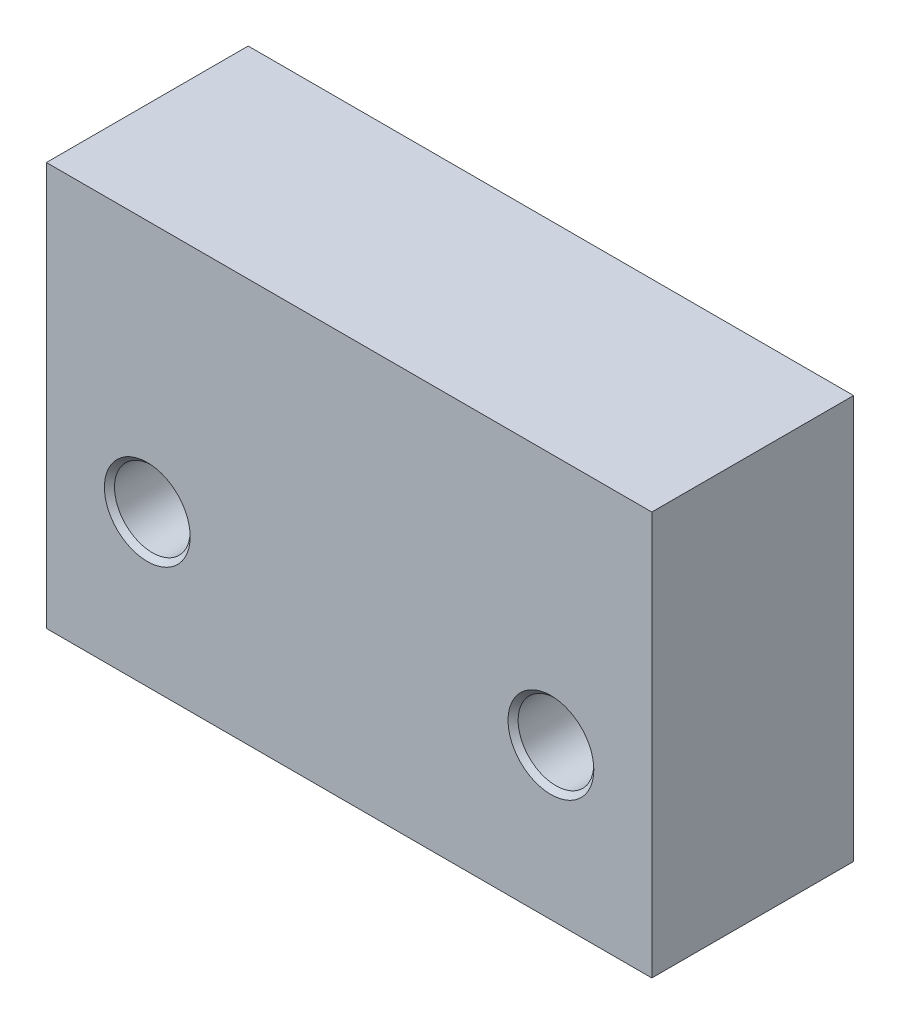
from build123d import *

# Parameters (mm, degrees)
SKETCH2_W                                  = 76.210747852
SKETCH2_H                                  = 50.8
BOSS_EXTRUDE1_DEPTH                        = 25.4
F_3_8_0_375_DIAMETER_HOLE1_D               = 9.525
F_3_8_0_375_DIAMETER_HOLE1_CSINK_D         = 10.795
F_3_8_0_375_DIAMETER_HOLE1_CSINK_ANGLE     = 90
F_35_64_0_54688_DIAMETER_HOLE1_D           = 13.890752
F_35_64_0_54688_DIAMETER_HOLE1_DEPTH       = 25.4
F_35_64_0_54688_DIAMETER_HOLE1_CSINK_D     = 15.160752
F_35_64_0_54688_DIAMETER_HOLE1_CSINK_ANGLE = 90
F_35_64_0_54688_DIAMETER_HOLE1_TIP         = 4.173202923


with BuildPart() as part:
    # Sketch2 → Boss-Extrude1 (new body)
    with BuildSketch(Plane.XY):
        with Locations((-1.384614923, 46.473347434)):
            Rectangle(SKETCH2_W, SKETCH2_H)
    extrude(amount=BOSS_EXTRUDE1_DEPTH)

    # 3_8 _0.375_ Diameter Hole1 (through all)
    with Locations(Plane.XY.offset(25.4)):
        with Locations((24.020759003, 40.123347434), (-26.789988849, 40.123347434)):
            CounterSinkHole(F_3_8_0_375_DIAMETER_HOLE1_D / 2, F_3_8_0_375_DIAMETER_HOLE1_CSINK_D / 2, counter_sink_angle=F_3_8_0_375_DIAMETER_HOLE1_CSINK_ANGLE)

    # 35_64 _0.54688_ Diameter Hole1
    with Locations(Plane(origin=(0, 21.073347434, 0), x_dir=(-1, 0, 0), z_dir=(0, -1, 0))):
        with Locations((1.389988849, -12.7)):
            CounterSinkHole(F_35_64_0_54688_DIAMETER_HOLE1_D / 2, F_35_64_0_54688_DIAMETER_HOLE1_CSINK_D / 2, depth=F_35_64_0_54688_DIAMETER_HOLE1_DEPTH, counter_sink_angle=F_35_64_0_54688_DIAMETER_HOLE1_CSINK_ANGLE)
            with Locations((0, 0, -(F_35_64_0_54688_DIAMETER_HOLE1_DEPTH + F_35_64_0_54688_DIAMETER_HOLE1_TIP / 2))):  # 118° drill point
                Cone(0, F_35_64_0_54688_DIAMETER_HOLE1_D / 2, F_35_64_0_54688_DIAMETER_HOLE1_TIP, mode=Mode.SUBTRACT)


solid = part.part
